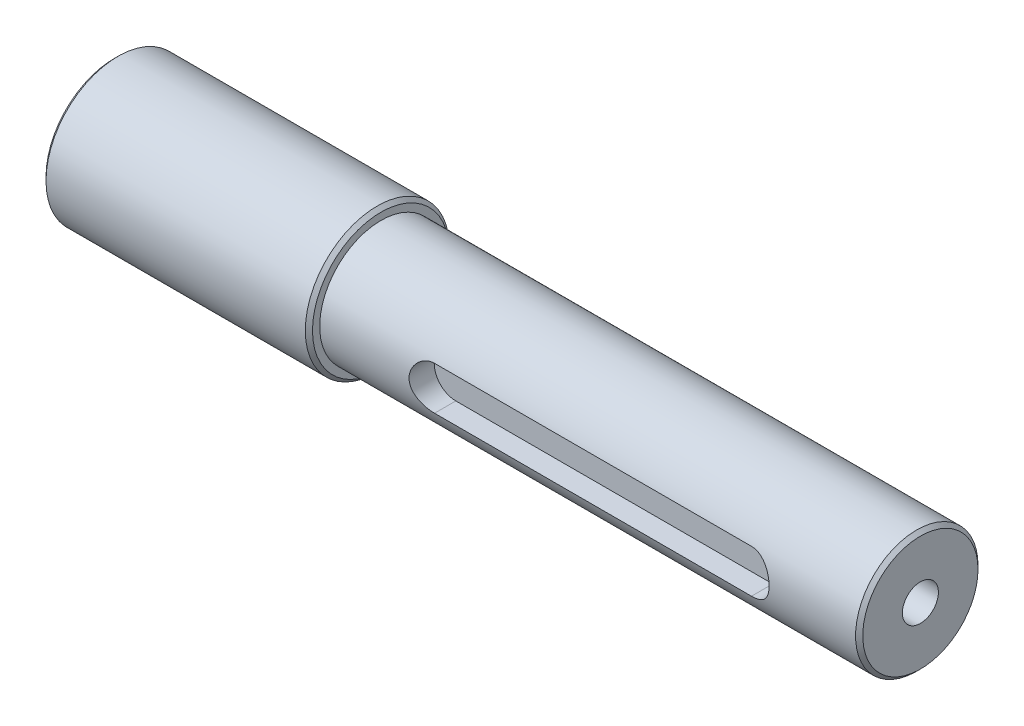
ISO-10303-21;
HEADER;
FILE_DESCRIPTION(('STEP AP214'),'2;1');
FILE_NAME('part.step','',(''),(''),'','','');
FILE_SCHEMA(('AUTOMOTIVE_DESIGN { 1 0 10303 214 1 1 1 1 }'));
ENDSEC;
DATA;
#1=APPLICATION_CONTEXT('core data for automotive mechanical design processes');
#2=APPLICATION_PROTOCOL_DEFINITION('international standard','automotive_design',2000,#1);
#3=PRODUCT_CONTEXT('',#1,'mechanical');
#4=PRODUCT('Part','Part','',(#3));
#5=PRODUCT_RELATED_PRODUCT_CATEGORY('part','',(#4));
#6=PRODUCT_DEFINITION_FORMATION('','',#4);
#7=PRODUCT_DEFINITION_CONTEXT('part definition',#1,'design');
#8=PRODUCT_DEFINITION('design','',#6,#7);
#9=PRODUCT_DEFINITION_SHAPE('','',#8);
#10=(LENGTH_UNIT() NAMED_UNIT(*) SI_UNIT(.MILLI.,.METRE.));
#11=(NAMED_UNIT(*) PLANE_ANGLE_UNIT() SI_UNIT($,.RADIAN.));
#12=(NAMED_UNIT(*) SI_UNIT($,.STERADIAN.) SOLID_ANGLE_UNIT());
#13=UNCERTAINTY_MEASURE_WITH_UNIT(LENGTH_MEASURE(1.E-05),#10,'distance_accuracy_value','');
#14=(GEOMETRIC_REPRESENTATION_CONTEXT(3) GLOBAL_UNCERTAINTY_ASSIGNED_CONTEXT((#13)) GLOBAL_UNIT_ASSIGNED_CONTEXT((#10,
#11,#12)) REPRESENTATION_CONTEXT('',''));
#15=CARTESIAN_POINT('',(0.,0.,0.));
#16=DIRECTION('',(0.,0.,1.));
#17=DIRECTION('',(1.,0.,0.));
#18=AXIS2_PLACEMENT_3D('',#15,#16,#17);
#19=CARTESIAN_POINT('',(74.9,0.,0.));
#20=DIRECTION('',(-1.,0.,0.));
#21=DIRECTION('',(0.,0.,1.));
#22=AXIS2_PLACEMENT_3D('',#19,#20,#21);
#23=CYLINDRICAL_SURFACE('',#22,8.5);
#24=CARTESIAN_POINT('',(74.4,0.,0.));
#25=DIRECTION('',(1.,0.,0.));
#26=DIRECTION('',(0.,0.,-1.));
#27=AXIS2_PLACEMENT_3D('',#24,#25,#26);
#28=CIRCLE('',#27,8.5);
#29=CARTESIAN_POINT('',(74.4,0.,-8.5));
#30=VERTEX_POINT('',#29);
#31=EDGE_CURVE('E183',#30,#30,#28,.F.);
#32=ORIENTED_EDGE('',*,*,#31,.T.);
#33=EDGE_LOOP('',(#32));
#34=FACE_BOUND('',#33,.T.);
#35=CARTESIAN_POINT('',(0.,0.,0.));
#36=DIRECTION('',(1.,0.,0.));
#37=DIRECTION('',(0.,0.,-1.));
#38=AXIS2_PLACEMENT_3D('',#35,#36,#37);
#39=CIRCLE('',#38,8.5);
#40=CARTESIAN_POINT('',(0.,0.,-8.5));
#41=VERTEX_POINT('',#40);
#42=EDGE_CURVE('E192',#41,#41,#39,.T.);
#43=ORIENTED_EDGE('',*,*,#42,.T.);
#44=EDGE_LOOP('',(#43));
#45=FACE_BOUND('',#44,.T.);
#46=CARTESIAN_POINT('',(15.4,-3.00000000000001,7.95298686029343));
#47=CARTESIAN_POINT('',(15.3184635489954,-3.0000111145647,7.95297282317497));
#48=CARTESIAN_POINT('',(15.23693486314,-2.99667616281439,7.95424043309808));
#49=CARTESIAN_POINT('',(15.0745166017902,-2.98340078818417,7.95923435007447));
#50=CARTESIAN_POINT('',(14.9936268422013,-2.97346234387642,7.96295992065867));
#51=CARTESIAN_POINT('',(14.8333191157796,-2.94710907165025,7.9727494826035));
#52=CARTESIAN_POINT('',(14.7538972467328,-2.93071521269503,7.97880590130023));
#53=CARTESIAN_POINT('',(14.5968362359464,-2.89162336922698,7.99305602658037));
#54=CARTESIAN_POINT('',(14.5191971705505,-2.86892511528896,8.00124982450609));
#55=CARTESIAN_POINT('',(14.2898576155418,-2.79169040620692,8.02866628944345));
#56=CARTESIAN_POINT('',(14.1414753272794,-2.72797079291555,8.05074111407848));
#57=CARTESIAN_POINT('',(13.8574726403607,-2.57807364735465,8.09998309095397));
#58=CARTESIAN_POINT('',(13.721861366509,-2.49188022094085,8.12715384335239));
#59=CARTESIAN_POINT('',(13.4612860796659,-2.29543806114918,8.18485393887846));
#60=CARTESIAN_POINT('',(13.336958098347,-2.18437050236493,8.21547377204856));
#61=CARTESIAN_POINT('',(13.1082557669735,-1.94307879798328,8.2758622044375));
#62=CARTESIAN_POINT('',(13.0038851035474,-1.81285112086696,8.30563064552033));
#63=CARTESIAN_POINT('',(12.8150629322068,-1.53216678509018,8.36202878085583));
#64=CARTESIAN_POINT('',(12.7312943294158,-1.38122456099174,8.38853913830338));
#65=CARTESIAN_POINT('',(12.5906004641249,-1.06629732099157,8.43435112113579));
#66=CARTESIAN_POINT('',(12.5336661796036,-0.902316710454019,8.45365516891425));
#67=CARTESIAN_POINT('',(12.450458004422,-0.572686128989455,8.48223599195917));
#68=CARTESIAN_POINT('',(12.4230845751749,-0.407345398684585,8.49187134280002));
#69=CARTESIAN_POINT('',(12.3962666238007,-0.0741521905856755,8.50130846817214));
#70=CARTESIAN_POINT('',(12.3968145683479,0.0936995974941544,8.50111289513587));
#71=CARTESIAN_POINT('',(12.4251535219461,0.419317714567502,8.49114603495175));
#72=CARTESIAN_POINT('',(12.4517473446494,0.577203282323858,8.4817955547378));
#73=CARTESIAN_POINT('',(12.5294271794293,0.886104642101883,8.4551088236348));
#74=CARTESIAN_POINT('',(12.5805145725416,1.03712004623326,8.43777212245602));
#75=CARTESIAN_POINT('',(12.7063643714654,1.33047393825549,8.39655303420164));
#76=CARTESIAN_POINT('',(12.7814457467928,1.47266277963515,8.3725830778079));
#77=CARTESIAN_POINT('',(12.9528785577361,1.74275783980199,8.32056133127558));
#78=CARTESIAN_POINT('',(13.0492363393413,1.87065978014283,8.29250832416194));
#79=CARTESIAN_POINT('',(13.2664012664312,2.11563702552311,8.23351601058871));
#80=CARTESIAN_POINT('',(13.3882233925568,2.23179650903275,8.20250248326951));
#81=CARTESIAN_POINT('',(13.6498392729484,2.44236946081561,8.1422878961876));
#82=CARTESIAN_POINT('',(13.7896393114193,2.53677529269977,8.11308747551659));
#83=CARTESIAN_POINT('',(14.0866698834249,2.70269404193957,8.05935715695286));
#84=CARTESIAN_POINT('',(14.2441711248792,2.77375950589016,8.03492183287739));
#85=CARTESIAN_POINT('',(14.4882503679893,2.85940108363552,8.00466863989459));
#86=CARTESIAN_POINT('',(14.5708983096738,2.88445274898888,7.99565197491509));
#87=CARTESIAN_POINT('',(14.7382505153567,2.92737680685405,7.98003696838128));
#88=CARTESIAN_POINT('',(14.8229538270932,2.94525245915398,7.97343752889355));
#89=CARTESIAN_POINT('',(14.9894985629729,2.97292025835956,7.96316283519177));
#90=CARTESIAN_POINT('',(15.071273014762,2.98306998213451,7.95935855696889));
#91=CARTESIAN_POINT('',(15.2353620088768,2.99661152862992,7.95426482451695));
#92=CARTESIAN_POINT('',(15.3176758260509,3.00001107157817,7.95297249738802));
#93=CARTESIAN_POINT('',(15.4,3.00000000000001,7.95298686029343));
#94=B_SPLINE_CURVE_WITH_KNOTS('',3,(#46,#47,#48,#49,#50,#51,#52,#53,#54,#55,#56,#57,#58,#59,#60,
#61,#62,#63,#64,#65,#66,#67,#68,#69,#70,#71,#72,#73,#74,#75,#76,#77,#78,#79,#80,#81,#82,#83,#84,
#85,#86,#87,#88,#89,#90,#91,#92,#93),.UNSPECIFIED.,.F.,.F.,(4,2,2,2,2,2,2,2,2,2,2,2,2,2,2,2,2,2,
2,2,2,2,2,4),(0.,0.244518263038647,0.488963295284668,0.732620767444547,0.976288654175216,
1.46284365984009,1.94974370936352,2.45596459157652,2.96227889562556,3.48361603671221,
4.00477777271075,4.50580525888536,5.00669756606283,5.48559776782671,5.96452497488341,
6.45010405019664,6.93582815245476,7.44695039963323,7.95825179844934,8.47884978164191,
8.73905037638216,8.99913263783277,9.2462895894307,9.49316370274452),.UNSPECIFIED.);
#95=CARTESIAN_POINT('',(15.4,-3.00000000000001,7.95298686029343));
#96=VERTEX_POINT('',#95);
#97=CARTESIAN_POINT('',(15.4,3.00000000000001,7.95298686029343));
#98=VERTEX_POINT('',#97);
#99=EDGE_CURVE('E96',#96,#98,#94,.T.);
#100=ORIENTED_EDGE('',*,*,#99,.T.);
#101=DIRECTION('',(-1.,0.,0.));
#102=VECTOR('',#101,1.);
#103=CARTESIAN_POINT('',(74.9,3.00000000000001,7.95298686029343));
#104=LINE('',#103,#102);
#105=CARTESIAN_POINT('',(59.4,3.00000000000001,7.95298686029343));
#106=VERTEX_POINT('',#105);
#107=EDGE_CURVE('E81',#98,#106,#104,.F.);
#108=ORIENTED_EDGE('',*,*,#107,.T.);
#109=CARTESIAN_POINT('',(59.4,3.00000000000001,7.95298686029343));
#110=CARTESIAN_POINT('',(59.4815364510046,3.0000111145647,7.95297282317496));
#111=CARTESIAN_POINT('',(59.56306513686,2.99667616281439,7.95424043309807));
#112=CARTESIAN_POINT('',(59.7254833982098,2.98340078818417,7.95923435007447));
#113=CARTESIAN_POINT('',(59.8063731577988,2.97346234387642,7.96295992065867));
#114=CARTESIAN_POINT('',(59.9666808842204,2.94710907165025,7.9727494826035));
#115=CARTESIAN_POINT('',(60.0461027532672,2.93071521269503,7.97880590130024));
#116=CARTESIAN_POINT('',(60.2031637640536,2.89162336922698,7.99305602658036));
#117=CARTESIAN_POINT('',(60.2808028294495,2.86892511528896,8.00124982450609));
#118=CARTESIAN_POINT('',(60.5101423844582,2.79169040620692,8.02866628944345));
#119=CARTESIAN_POINT('',(60.6585246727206,2.72797079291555,8.05074111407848));
#120=CARTESIAN_POINT('',(60.9425273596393,2.57807364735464,8.09998309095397));
#121=CARTESIAN_POINT('',(61.0781386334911,2.49188022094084,8.12715384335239));
#122=CARTESIAN_POINT('',(61.3387139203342,2.29543806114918,8.18485393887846));
#123=CARTESIAN_POINT('',(61.463041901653,2.18437050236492,8.21547377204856));
#124=CARTESIAN_POINT('',(61.6917442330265,1.94307879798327,8.2758622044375));
#125=CARTESIAN_POINT('',(61.7961148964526,1.81285112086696,8.30563064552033));
#126=CARTESIAN_POINT('',(61.9849370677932,1.53216678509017,8.36202878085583));
#127=CARTESIAN_POINT('',(62.0687056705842,1.38122456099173,8.38853913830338));
#128=CARTESIAN_POINT('',(62.2093995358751,1.06629732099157,8.43435112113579));
#129=CARTESIAN_POINT('',(62.2663338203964,0.902316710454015,8.45365516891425));
#130=CARTESIAN_POINT('',(62.349541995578,0.57268612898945,8.48223599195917));
#131=CARTESIAN_POINT('',(62.3769154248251,0.40734539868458,8.49187134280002));
#132=CARTESIAN_POINT('',(62.4037333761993,0.0741521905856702,8.50130846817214));
#133=CARTESIAN_POINT('',(62.4031854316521,-0.0936995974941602,8.50111289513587));
#134=CARTESIAN_POINT('',(62.3748464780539,-0.419317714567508,8.49114603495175));
#135=CARTESIAN_POINT('',(62.3482526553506,-0.577203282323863,8.4817955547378));
#136=CARTESIAN_POINT('',(62.2705728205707,-0.886104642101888,8.4551088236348));
#137=CARTESIAN_POINT('',(62.2194854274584,-1.03712004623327,8.43777212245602));
#138=CARTESIAN_POINT('',(62.0936356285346,-1.3304739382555,8.39655303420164));
#139=CARTESIAN_POINT('',(62.0185542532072,-1.47266277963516,8.3725830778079));
#140=CARTESIAN_POINT('',(61.847121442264,-1.742757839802,8.32056133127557));
#141=CARTESIAN_POINT('',(61.7507636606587,-1.87065978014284,8.29250832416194));
#142=CARTESIAN_POINT('',(61.5335987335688,-2.11563702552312,8.23351601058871));
#143=CARTESIAN_POINT('',(61.4117766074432,-2.23179650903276,8.20250248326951));
#144=CARTESIAN_POINT('',(61.1501607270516,-2.44236946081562,8.1422878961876));
#145=CARTESIAN_POINT('',(61.0103606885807,-2.53677529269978,8.11308747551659));
#146=CARTESIAN_POINT('',(60.7133301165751,-2.70269404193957,8.05935715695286));
#147=CARTESIAN_POINT('',(60.5558288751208,-2.77375950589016,8.03492183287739));
#148=CARTESIAN_POINT('',(60.3117496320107,-2.85940108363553,8.00466863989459));
#149=CARTESIAN_POINT('',(60.2291016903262,-2.88445274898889,7.99565197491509));
#150=CARTESIAN_POINT('',(60.0617494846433,-2.92737680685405,7.98003696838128));
#151=CARTESIAN_POINT('',(59.9770461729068,-2.94525245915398,7.97343752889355));
#152=CARTESIAN_POINT('',(59.8105014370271,-2.97292025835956,7.96316283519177));
#153=CARTESIAN_POINT('',(59.7287269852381,-2.98306998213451,7.95935855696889));
#154=CARTESIAN_POINT('',(59.5646379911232,-2.99661152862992,7.95426482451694));
#155=CARTESIAN_POINT('',(59.4823241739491,-3.00001107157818,7.95297249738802));
#156=CARTESIAN_POINT('',(59.4,-3.00000000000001,7.95298686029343));
#157=B_SPLINE_CURVE_WITH_KNOTS('',3,(#109,#110,#111,#112,#113,#114,#115,#116,#117,#118,#119,
#120,#121,#122,#123,#124,#125,#126,#127,#128,#129,#130,#131,#132,#133,#134,#135,#136,#137,#138,
#139,#140,#141,#142,#143,#144,#145,#146,#147,#148,#149,#150,#151,#152,#153,#154,#155,#156),
.UNSPECIFIED.,.F.,.F.,(4,2,2,2,2,2,2,2,2,2,2,2,2,2,2,2,2,2,2,2,2,2,2,4),(0.,0.244518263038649,
0.488963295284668,0.732620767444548,0.97628865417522,1.46284365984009,1.94974370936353,
2.45596459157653,2.96227889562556,3.48361603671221,4.00477777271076,4.50580525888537,
5.00669756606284,5.48559776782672,5.96452497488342,6.45010405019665,6.93582815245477,
7.44695039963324,7.95825179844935,8.47884978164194,8.73905037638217,8.99913263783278,
9.2462895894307,9.49316370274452),.UNSPECIFIED.);
#158=CARTESIAN_POINT('',(59.4,-3.00000000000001,7.95298686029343));
#159=VERTEX_POINT('',#158);
#160=EDGE_CURVE('E111',#106,#159,#157,.T.);
#161=ORIENTED_EDGE('',*,*,#160,.T.);
#162=DIRECTION('',(-1.,0.,0.));
#163=VECTOR('',#162,1.);
#164=CARTESIAN_POINT('',(74.9,-3.00000000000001,7.95298686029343));
#165=LINE('',#164,#163);
#166=EDGE_CURVE('E104',#159,#96,#165,.T.);
#167=ORIENTED_EDGE('',*,*,#166,.T.);
#168=EDGE_LOOP('',(#100,#108,#161,#167));
#169=FACE_BOUND('',#168,.T.);
#170=ADVANCED_FACE('F41',(#34,#45,#169),#23,.T.);
#171=CARTESIAN_POINT('',(74.9,0.,0.));
#172=DIRECTION('',(1.,0.,0.));
#173=DIRECTION('',(0.,0.,-1.));
#174=AXIS2_PLACEMENT_3D('',#171,#172,#173);
#175=PLANE('',#174);
#176=CARTESIAN_POINT('',(74.9,0.,0.));
#177=DIRECTION('',(1.,0.,0.));
#178=DIRECTION('',(0.,0.,-1.));
#179=AXIS2_PLACEMENT_3D('',#176,#177,#178);
#180=CIRCLE('',#179,8.00000000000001);
#181=CARTESIAN_POINT('',(74.9,0.,-8.00000000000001));
#182=VERTEX_POINT('',#181);
#183=EDGE_CURVE('E188',#182,#182,#180,.T.);
#184=ORIENTED_EDGE('',*,*,#183,.T.);
#185=EDGE_LOOP('',(#184));
#186=FACE_BOUND('',#185,.T.);
#187=CARTESIAN_POINT('',(74.9,0.,0.));
#188=DIRECTION('',(1.,0.,0.));
#189=DIRECTION('',(0.,0.,-1.));
#190=AXIS2_PLACEMENT_3D('',#187,#188,#189);
#191=CIRCLE('',#190,2.49999999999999);
#192=CARTESIAN_POINT('',(74.9,0.,-2.49999999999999));
#193=VERTEX_POINT('',#192);
#194=EDGE_CURVE('E90',#193,#193,#191,.T.);
#195=ORIENTED_EDGE('',*,*,#194,.F.);
#196=EDGE_LOOP('',(#195));
#197=FACE_BOUND('',#196,.T.);
#198=ADVANCED_FACE('F147',(#186,#197),#175,.T.);
#199=CARTESIAN_POINT('',(-37.,0.,0.));
#200=DIRECTION('',(1.,0.,0.));
#201=DIRECTION('',(0.,0.,-1.));
#202=AXIS2_PLACEMENT_3D('',#199,#200,#201);
#203=CYLINDRICAL_SURFACE('',#202,10.);
#204=CARTESIAN_POINT('',(-0.500000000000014,0.,0.));
#205=DIRECTION('',(-1.,0.,0.));
#206=DIRECTION('',(0.,0.,1.));
#207=AXIS2_PLACEMENT_3D('',#204,#205,#206);
#208=CIRCLE('',#207,10.);
#209=CARTESIAN_POINT('',(-0.500000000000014,0.,10.));
#210=VERTEX_POINT('',#209);
#211=EDGE_CURVE('E175',#210,#210,#208,.T.);
#212=ORIENTED_EDGE('',*,*,#211,.T.);
#213=EDGE_LOOP('',(#212));
#214=FACE_BOUND('',#213,.T.);
#215=CARTESIAN_POINT('',(-36.5,0.,0.));
#216=DIRECTION('',(-1.,0.,0.));
#217=DIRECTION('',(0.,0.,1.));
#218=AXIS2_PLACEMENT_3D('',#215,#216,#217);
#219=CIRCLE('',#218,10.);
#220=CARTESIAN_POINT('',(-36.5,0.,10.));
#221=VERTEX_POINT('',#220);
#222=EDGE_CURVE('E178',#221,#221,#219,.F.);
#223=ORIENTED_EDGE('',*,*,#222,.T.);
#224=EDGE_LOOP('',(#223));
#225=FACE_BOUND('',#224,.T.);
#226=ADVANCED_FACE('F153',(#214,#225),#203,.T.);
#227=CARTESIAN_POINT('',(-37.,0.,0.));
#228=DIRECTION('',(-1.,0.,0.));
#229=DIRECTION('',(0.,0.,1.));
#230=AXIS2_PLACEMENT_3D('',#227,#228,#229);
#231=PLANE('',#230);
#232=CARTESIAN_POINT('',(-37.,0.,0.));
#233=DIRECTION('',(-1.,0.,0.));
#234=DIRECTION('',(0.,0.,1.));
#235=AXIS2_PLACEMENT_3D('',#232,#233,#234);
#236=CIRCLE('',#235,9.50000000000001);
#237=CARTESIAN_POINT('',(-37.,0.,9.50000000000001));
#238=VERTEX_POINT('',#237);
#239=EDGE_CURVE('E11',#238,#238,#236,.T.);
#240=ORIENTED_EDGE('',*,*,#239,.T.);
#241=EDGE_LOOP('',(#240));
#242=FACE_BOUND('',#241,.T.);
#243=ADVANCED_FACE('F269',(#242),#231,.T.);
#244=CARTESIAN_POINT('',(0.,0.,0.));
#245=DIRECTION('',(-1.,0.,0.));
#246=DIRECTION('',(0.,0.,1.));
#247=AXIS2_PLACEMENT_3D('',#244,#245,#246);
#248=PLANE('',#247);
#249=CARTESIAN_POINT('',(0.,0.,0.));
#250=DIRECTION('',(-1.,0.,0.));
#251=DIRECTION('',(0.,0.,1.));
#252=AXIS2_PLACEMENT_3D('',#249,#250,#251);
#253=CIRCLE('',#252,9.49999999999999);
#254=CARTESIAN_POINT('',(0.,0.,9.49999999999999));
#255=VERTEX_POINT('',#254);
#256=EDGE_CURVE('E50',#255,#255,#253,.F.);
#257=ORIENTED_EDGE('',*,*,#256,.T.);
#258=EDGE_LOOP('',(#257));
#259=FACE_BOUND('',#258,.T.);
#260=ORIENTED_EDGE('',*,*,#42,.F.);
#261=EDGE_LOOP('',(#260));
#262=FACE_BOUND('',#261,.T.);
#263=ADVANCED_FACE('F259',(#259,#262),#248,.F.);
#264=CARTESIAN_POINT('',(44.9,0.,0.));
#265=DIRECTION('',(1.,0.,0.));
#266=DIRECTION('',(0.,0.,-1.));
#267=AXIS2_PLACEMENT_3D('',#264,#265,#266);
#268=CONICAL_SURFACE('',#267,2.49999999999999,1.02974425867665);
#269=CARTESIAN_POINT('',(43.3978484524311,0.,0.));
#270=VERTEX_POINT('',#269);
#271=VERTEX_LOOP('',#270);
#272=FACE_BOUND('',#271,.T.);
#273=CARTESIAN_POINT('',(44.9,0.,0.));
#274=DIRECTION('',(1.,0.,0.));
#275=DIRECTION('',(0.,0.,-1.));
#276=AXIS2_PLACEMENT_3D('',#273,#274,#275);
#277=CIRCLE('',#276,2.49999999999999);
#278=CARTESIAN_POINT('',(44.9,0.,-2.49999999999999));
#279=VERTEX_POINT('',#278);
#280=EDGE_CURVE('E196',#279,#279,#277,.T.);
#281=ORIENTED_EDGE('',*,*,#280,.T.);
#282=EDGE_LOOP('',(#281));
#283=FACE_BOUND('',#282,.T.);
#284=ADVANCED_FACE('F251',(#272,#283),#268,.F.);
#285=CARTESIAN_POINT('',(74.9,0.,0.));
#286=DIRECTION('',(1.,0.,0.));
#287=DIRECTION('',(0.,0.,-1.));
#288=AXIS2_PLACEMENT_3D('',#285,#286,#287);
#289=CYLINDRICAL_SURFACE('',#288,2.49999999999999);
#290=ORIENTED_EDGE('',*,*,#280,.F.);
#291=EDGE_LOOP('',(#290));
#292=FACE_BOUND('',#291,.T.);
#293=ORIENTED_EDGE('',*,*,#194,.T.);
#294=EDGE_LOOP('',(#293));
#295=FACE_BOUND('',#294,.T.);
#296=ADVANCED_FACE('F145',(#292,#295),#289,.F.);
#297=CARTESIAN_POINT('',(15.4,0.,10.001));
#298=DIRECTION('',(0.,0.,-1.));
#299=DIRECTION('',(-1.,0.,0.));
#300=AXIS2_PLACEMENT_3D('',#297,#298,#299);
#301=CYLINDRICAL_SURFACE('',#300,3.00000000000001);
#302=DIRECTION('',(0.,0.,-1.));
#303=VECTOR('',#302,1.);
#304=CARTESIAN_POINT('',(15.4,-3.00000000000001,10.001));
#305=LINE('',#304,#303);
#306=CARTESIAN_POINT('',(15.4,-3.00000000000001,5.));
#307=VERTEX_POINT('',#306);
#308=EDGE_CURVE('E91',#96,#307,#305,.T.);
#309=ORIENTED_EDGE('',*,*,#308,.T.);
#310=CARTESIAN_POINT('',(15.4,0.,5.));
#311=DIRECTION('',(0.,0.,1.));
#312=DIRECTION('',(1.,0.,0.));
#313=AXIS2_PLACEMENT_3D('',#310,#311,#312);
#314=CIRCLE('',#313,3.00000000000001);
#315=CARTESIAN_POINT('',(15.4,3.00000000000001,5.));
#316=VERTEX_POINT('',#315);
#317=EDGE_CURVE('E99',#316,#307,#314,.T.);
#318=ORIENTED_EDGE('',*,*,#317,.F.);
#319=DIRECTION('',(0.,0.,-1.));
#320=VECTOR('',#319,1.);
#321=CARTESIAN_POINT('',(15.4,3.00000000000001,10.001));
#322=LINE('',#321,#320);
#323=EDGE_CURVE('E84',#98,#316,#322,.T.);
#324=ORIENTED_EDGE('',*,*,#323,.F.);
#325=ORIENTED_EDGE('',*,*,#99,.F.);
#326=EDGE_LOOP('',(#309,#318,#324,#325));
#327=FACE_BOUND('',#326,.T.);
#328=ADVANCED_FACE('F95',(#327),#301,.F.);
#329=CARTESIAN_POINT('',(15.4,-3.00000000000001,10.001));
#330=DIRECTION('',(0.,1.,0.));
#331=DIRECTION('',(0.,0.,1.));
#332=AXIS2_PLACEMENT_3D('',#329,#330,#331);
#333=PLANE('',#332);
#334=DIRECTION('',(0.,0.,-1.));
#335=VECTOR('',#334,1.);
#336=CARTESIAN_POINT('',(59.4,-3.00000000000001,10.001));
#337=LINE('',#336,#335);
#338=CARTESIAN_POINT('',(59.4,-3.00000000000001,5.));
#339=VERTEX_POINT('',#338);
#340=EDGE_CURVE('E205',#159,#339,#337,.T.);
#341=ORIENTED_EDGE('',*,*,#340,.T.);
#342=DIRECTION('',(1.,0.,0.));
#343=VECTOR('',#342,1.);
#344=CARTESIAN_POINT('',(15.4,-3.00000000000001,5.));
#345=LINE('',#344,#343);
#346=EDGE_CURVE('E109',#307,#339,#345,.T.);
#347=ORIENTED_EDGE('',*,*,#346,.F.);
#348=ORIENTED_EDGE('',*,*,#308,.F.);
#349=ORIENTED_EDGE('',*,*,#166,.F.);
#350=EDGE_LOOP('',(#341,#347,#348,#349));
#351=FACE_BOUND('',#350,.T.);
#352=ADVANCED_FACE('F138',(#351),#333,.T.);
#353=CARTESIAN_POINT('',(59.4,0.,10.001));
#354=DIRECTION('',(0.,0.,-1.));
#355=DIRECTION('',(-1.,0.,0.));
#356=AXIS2_PLACEMENT_3D('',#353,#354,#355);
#357=CYLINDRICAL_SURFACE('',#356,3.00000000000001);
#358=DIRECTION('',(0.,0.,-1.));
#359=VECTOR('',#358,1.);
#360=CARTESIAN_POINT('',(59.4,3.00000000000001,10.001));
#361=LINE('',#360,#359);
#362=CARTESIAN_POINT('',(59.4,3.00000000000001,5.));
#363=VERTEX_POINT('',#362);
#364=EDGE_CURVE('E57',#106,#363,#361,.T.);
#365=ORIENTED_EDGE('',*,*,#364,.T.);
#366=CARTESIAN_POINT('',(59.4,0.,5.));
#367=DIRECTION('',(0.,0.,1.));
#368=DIRECTION('',(1.,0.,0.));
#369=AXIS2_PLACEMENT_3D('',#366,#367,#368);
#370=CIRCLE('',#369,3.00000000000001);
#371=EDGE_CURVE('E212',#339,#363,#370,.T.);
#372=ORIENTED_EDGE('',*,*,#371,.F.);
#373=ORIENTED_EDGE('',*,*,#340,.F.);
#374=ORIENTED_EDGE('',*,*,#160,.F.);
#375=EDGE_LOOP('',(#365,#372,#373,#374));
#376=FACE_BOUND('',#375,.T.);
#377=ADVANCED_FACE('F135',(#376),#357,.F.);
#378=CARTESIAN_POINT('',(15.4,3.00000000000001,10.001));
#379=DIRECTION('',(0.,-1.,0.));
#380=DIRECTION('',(0.,0.,-1.));
#381=AXIS2_PLACEMENT_3D('',#378,#379,#380);
#382=PLANE('',#381);
#383=ORIENTED_EDGE('',*,*,#323,.T.);
#384=DIRECTION('',(-1.,0.,0.));
#385=VECTOR('',#384,1.);
#386=CARTESIAN_POINT('',(15.4,3.00000000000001,5.));
#387=LINE('',#386,#385);
#388=EDGE_CURVE('E101',#363,#316,#387,.T.);
#389=ORIENTED_EDGE('',*,*,#388,.F.);
#390=ORIENTED_EDGE('',*,*,#364,.F.);
#391=ORIENTED_EDGE('',*,*,#107,.F.);
#392=EDGE_LOOP('',(#383,#389,#390,#391));
#393=FACE_BOUND('',#392,.T.);
#394=ADVANCED_FACE('F83',(#393),#382,.T.);
#395=CARTESIAN_POINT('',(15.4,0.,5.));
#396=DIRECTION('',(0.,0.,1.));
#397=DIRECTION('',(1.,0.,0.));
#398=AXIS2_PLACEMENT_3D('',#395,#396,#397);
#399=PLANE('',#398);
#400=ORIENTED_EDGE('',*,*,#317,.T.);
#401=ORIENTED_EDGE('',*,*,#346,.T.);
#402=ORIENTED_EDGE('',*,*,#371,.T.);
#403=ORIENTED_EDGE('',*,*,#388,.T.);
#404=EDGE_LOOP('',(#400,#401,#402,#403));
#405=FACE_BOUND('',#404,.T.);
#406=ADVANCED_FACE('F126',(#405),#399,.T.);
#407=CARTESIAN_POINT('',(74.9,0.,0.));
#408=DIRECTION('',(-1.,0.,0.));
#409=DIRECTION('',(0.,0.,1.));
#410=AXIS2_PLACEMENT_3D('',#407,#408,#409);
#411=CONICAL_SURFACE('',#410,8.00000000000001,0.785398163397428);
#412=ORIENTED_EDGE('',*,*,#31,.F.);
#413=EDGE_LOOP('',(#412));
#414=FACE_BOUND('',#413,.T.);
#415=ORIENTED_EDGE('',*,*,#183,.F.);
#416=EDGE_LOOP('',(#415));
#417=FACE_BOUND('',#416,.T.);
#418=ADVANCED_FACE('F160',(#414,#417),#411,.T.);
#419=CARTESIAN_POINT('',(-0.500000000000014,0.,0.));
#420=DIRECTION('',(-1.,0.,0.));
#421=DIRECTION('',(0.,0.,1.));
#422=AXIS2_PLACEMENT_3D('',#419,#420,#421);
#423=CONICAL_SURFACE('',#422,10.,0.78539816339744);
#424=ORIENTED_EDGE('',*,*,#256,.F.);
#425=EDGE_LOOP('',(#424));
#426=FACE_BOUND('',#425,.T.);
#427=ORIENTED_EDGE('',*,*,#211,.F.);
#428=EDGE_LOOP('',(#427));
#429=FACE_BOUND('',#428,.T.);
#430=ADVANCED_FACE('F162',(#426,#429),#423,.T.);
#431=CARTESIAN_POINT('',(-37.,0.,0.));
#432=DIRECTION('',(1.,0.,0.));
#433=DIRECTION('',(0.,0.,-1.));
#434=AXIS2_PLACEMENT_3D('',#431,#432,#433);
#435=CONICAL_SURFACE('',#434,9.50000000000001,0.78539816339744);
#436=ORIENTED_EDGE('',*,*,#222,.F.);
#437=EDGE_LOOP('',(#436));
#438=FACE_BOUND('',#437,.T.);
#439=ORIENTED_EDGE('',*,*,#239,.F.);
#440=EDGE_LOOP('',(#439));
#441=FACE_BOUND('',#440,.T.);
#442=ADVANCED_FACE('F43',(#438,#441),#435,.T.);
#443=CLOSED_SHELL('',(#170,#198,#226,#243,#263,#284,#296,#328,#352,#377,#394,#406,#418,#430,#442));
#444=MANIFOLD_SOLID_BREP('B2',#443);
#445=ADVANCED_BREP_SHAPE_REPRESENTATION('',(#18,#444),#14);
#446=SHAPE_DEFINITION_REPRESENTATION(#9,#445);
ENDSEC;
END-ISO-10303-21;
